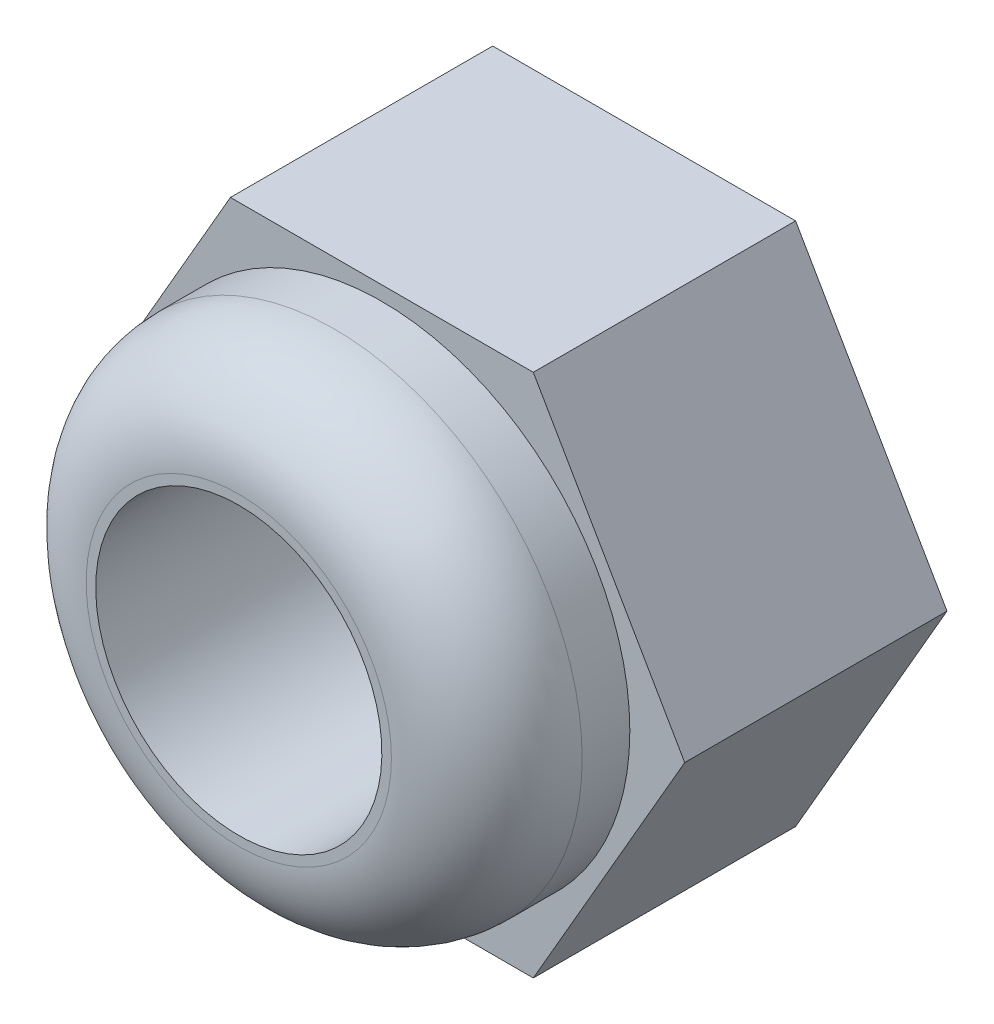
from build123d import *

# Parameters (mm, degrees)
EXTRUDE_1_DEPTH       = 2.75
SKETCH_2_W            = 2.6
SKETCH_2_H            = 1.5
HOLE_WIZARD_3_0_3_1_D = 3
FILLET_1_R            = 1


with BuildPart() as part:
    # Sketch 1 → Extrude 1 (new body)
    with BuildSketch(Plane.XY.offset(2.75)):
        Polygon((1.58771324, -2.75), (3.175426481, 0), (1.58771324, 2.75), (-1.58771324, 2.75), (-3.175426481, 0), (-1.58771324, -2.75), align=None)
    extrude(amount=-EXTRUDE_1_DEPTH)

    # Sketch 2 → Revolve 1 (revolve)
    with BuildSketch(Plane(origin=(0, 0, 0), x_dir=(1, 0, 0), z_dir=(0, 1, 0))):
        with Locations((1.3, -3.5)):
            Rectangle(SKETCH_2_W, SKETCH_2_H)
    revolve(axis=Axis((0, 0, 2.75), (0, 0, 1)))

    # Hole Wizard 3.0 _3_ _1 (through all)
    with Locations(Plane(origin=(0, 0, 0), x_dir=(-1, 0, 0), z_dir=(0, 0, -1))):
        with Locations((0, 0)):
            Hole(HOLE_WIZARD_3_0_3_1_D / 2)

    # Fillet 1
    fillet_1_edges = [part.edges().sort_by_distance(p)[0] for p in [
        (-2.6, 0, 4.25),
    ]]
    fillet(fillet_1_edges, radius=FILLET_1_R)


solid = part.part
